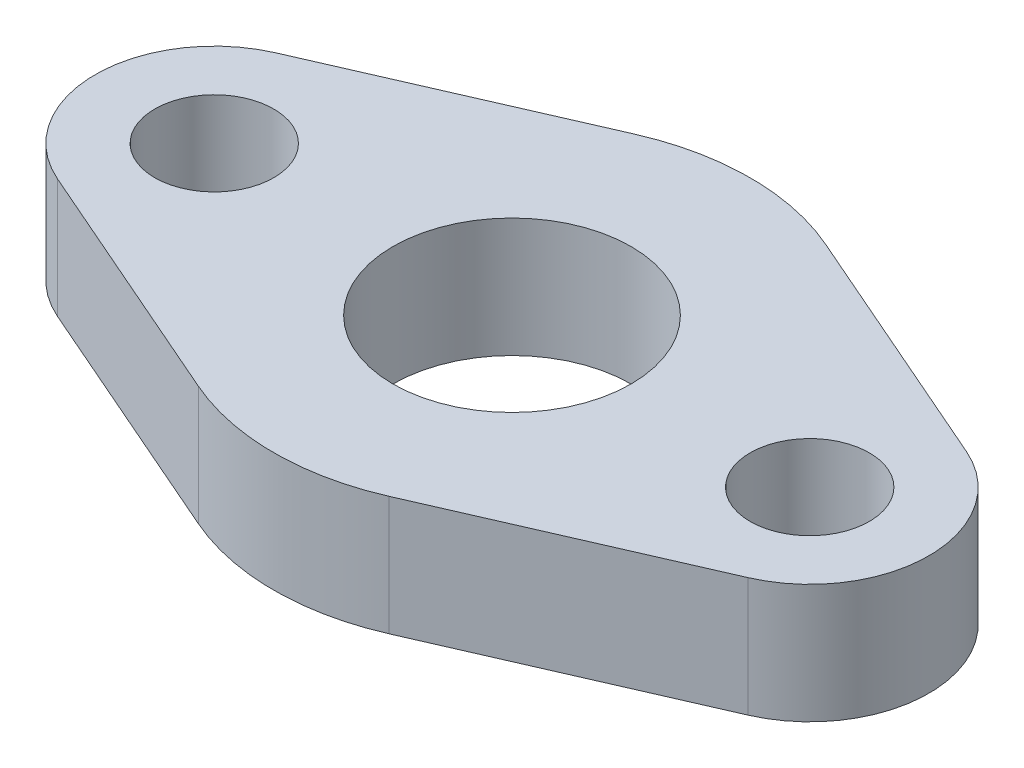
ISO-10303-21;
HEADER;
FILE_DESCRIPTION(('STEP AP214'),'2;1');
FILE_NAME('part.step','',(''),(''),'','','');
FILE_SCHEMA(('AUTOMOTIVE_DESIGN { 1 0 10303 214 1 1 1 1 }'));
ENDSEC;
DATA;
#1=APPLICATION_CONTEXT('core data for automotive mechanical design processes');
#2=APPLICATION_PROTOCOL_DEFINITION('international standard','automotive_design',2000,#1);
#3=PRODUCT_CONTEXT('',#1,'mechanical');
#4=PRODUCT('Part','Part','',(#3));
#5=PRODUCT_RELATED_PRODUCT_CATEGORY('part','',(#4));
#6=PRODUCT_DEFINITION_FORMATION('','',#4);
#7=PRODUCT_DEFINITION_CONTEXT('part definition',#1,'design');
#8=PRODUCT_DEFINITION('design','',#6,#7);
#9=PRODUCT_DEFINITION_SHAPE('','',#8);
#10=(LENGTH_UNIT() NAMED_UNIT(*) SI_UNIT(.MILLI.,.METRE.));
#11=(NAMED_UNIT(*) PLANE_ANGLE_UNIT() SI_UNIT($,.RADIAN.));
#12=(NAMED_UNIT(*) SI_UNIT($,.STERADIAN.) SOLID_ANGLE_UNIT());
#13=UNCERTAINTY_MEASURE_WITH_UNIT(LENGTH_MEASURE(1.E-05),#10,'distance_accuracy_value','');
#14=(GEOMETRIC_REPRESENTATION_CONTEXT(3) GLOBAL_UNCERTAINTY_ASSIGNED_CONTEXT((#13)) GLOBAL_UNIT_ASSIGNED_CONTEXT((#10,
#11,#12)) REPRESENTATION_CONTEXT('',''));
#15=CARTESIAN_POINT('',(0.,0.,0.));
#16=DIRECTION('',(0.,0.,1.));
#17=DIRECTION('',(1.,0.,0.));
#18=AXIS2_PLACEMENT_3D('',#15,#16,#17);
#19=CARTESIAN_POINT('',(0.,40.,0.));
#20=DIRECTION('',(0.,1.,0.));
#21=DIRECTION('',(0.,0.,1.));
#22=AXIS2_PLACEMENT_3D('',#19,#20,#21);
#23=PLANE('',#22);
#24=CARTESIAN_POINT('',(100.,40.,0.));
#25=DIRECTION('',(0.,1.,0.));
#26=DIRECTION('',(0.,0.,1.));
#27=AXIS2_PLACEMENT_3D('',#24,#25,#26);
#28=CIRCLE('',#27,20.);
#29=CARTESIAN_POINT('',(100.,40.,20.));
#30=VERTEX_POINT('',#29);
#31=EDGE_CURVE('E180',#30,#30,#28,.T.);
#32=ORIENTED_EDGE('',*,*,#31,.F.);
#33=EDGE_LOOP('',(#32));
#34=FACE_BOUND('',#33,.T.);
#35=CARTESIAN_POINT('',(0.,40.,0.));
#36=DIRECTION('',(0.,1.,0.));
#37=DIRECTION('',(0.,0.,1.));
#38=AXIS2_PLACEMENT_3D('',#35,#36,#37);
#39=CIRCLE('',#38,80.);
#40=CARTESIAN_POINT('',(32.,40.,-73.3212111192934));
#41=VERTEX_POINT('',#40);
#42=CARTESIAN_POINT('',(-32.,40.,-73.3212111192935));
#43=VERTEX_POINT('',#42);
#44=EDGE_CURVE('E143',#41,#43,#39,.T.);
#45=ORIENTED_EDGE('',*,*,#44,.T.);
#46=DIRECTION('',(-0.916515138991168,0.,0.4));
#47=VECTOR('',#46,1.);
#48=CARTESIAN_POINT('',(-32.,40.,-73.3212111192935));
#49=LINE('',#48,#47);
#50=CARTESIAN_POINT('',(-116.,40.,-36.6606055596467));
#51=VERTEX_POINT('',#50);
#52=EDGE_CURVE('E91',#43,#51,#49,.T.);
#53=ORIENTED_EDGE('',*,*,#52,.T.);
#54=CARTESIAN_POINT('',(-100.,40.,0.));
#55=DIRECTION('',(0.,1.,0.));
#56=DIRECTION('',(0.,0.,1.));
#57=AXIS2_PLACEMENT_3D('',#54,#55,#56);
#58=CIRCLE('',#57,40.);
#59=CARTESIAN_POINT('',(-116.,40.,36.6606055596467));
#60=VERTEX_POINT('',#59);
#61=EDGE_CURVE('E158',#51,#60,#58,.T.);
#62=ORIENTED_EDGE('',*,*,#61,.T.);
#63=DIRECTION('',(0.916515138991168,0.,0.4));
#64=VECTOR('',#63,1.);
#65=CARTESIAN_POINT('',(-32.,40.,73.3212111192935));
#66=LINE('',#65,#64);
#67=CARTESIAN_POINT('',(-32.,40.,73.3212111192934));
#68=VERTEX_POINT('',#67);
#69=EDGE_CURVE('E171',#60,#68,#66,.T.);
#70=ORIENTED_EDGE('',*,*,#69,.T.);
#71=CARTESIAN_POINT('',(0.,40.,0.));
#72=DIRECTION('',(0.,1.,0.));
#73=DIRECTION('',(0.,0.,1.));
#74=AXIS2_PLACEMENT_3D('',#71,#72,#73);
#75=CIRCLE('',#74,80.);
#76=CARTESIAN_POINT('',(32.,40.,73.3212111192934));
#77=VERTEX_POINT('',#76);
#78=EDGE_CURVE('E110',#68,#77,#75,.T.);
#79=ORIENTED_EDGE('',*,*,#78,.T.);
#80=DIRECTION('',(0.916515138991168,0.,-0.4));
#81=VECTOR('',#80,1.);
#82=CARTESIAN_POINT('',(116.,40.,36.6606055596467));
#83=LINE('',#82,#81);
#84=CARTESIAN_POINT('',(116.,40.,36.6606055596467));
#85=VERTEX_POINT('',#84);
#86=EDGE_CURVE('E104',#77,#85,#83,.T.);
#87=ORIENTED_EDGE('',*,*,#86,.T.);
#88=CARTESIAN_POINT('',(100.,40.,0.));
#89=DIRECTION('',(0.,1.,0.));
#90=DIRECTION('',(0.,0.,1.));
#91=AXIS2_PLACEMENT_3D('',#88,#89,#90);
#92=CIRCLE('',#91,40.);
#93=CARTESIAN_POINT('',(116.,40.,-36.6606055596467));
#94=VERTEX_POINT('',#93);
#95=EDGE_CURVE('E108',#85,#94,#92,.T.);
#96=ORIENTED_EDGE('',*,*,#95,.T.);
#97=DIRECTION('',(-0.916515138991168,0.,-0.4));
#98=VECTOR('',#97,1.);
#99=CARTESIAN_POINT('',(32.,40.,-73.3212111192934));
#100=LINE('',#99,#98);
#101=EDGE_CURVE('E48',#94,#41,#100,.T.);
#102=ORIENTED_EDGE('',*,*,#101,.T.);
#103=EDGE_LOOP('',(#45,#53,#62,#70,#79,#87,#96,#102));
#104=FACE_BOUND('',#103,.T.);
#105=CARTESIAN_POINT('',(0.,40.,0.));
#106=DIRECTION('',(0.,1.,0.));
#107=DIRECTION('',(0.,0.,1.));
#108=AXIS2_PLACEMENT_3D('',#105,#106,#107);
#109=CIRCLE('',#108,40.);
#110=CARTESIAN_POINT('',(0.,40.,40.));
#111=VERTEX_POINT('',#110);
#112=EDGE_CURVE('E132',#111,#111,#109,.T.);
#113=ORIENTED_EDGE('',*,*,#112,.F.);
#114=EDGE_LOOP('',(#113));
#115=FACE_BOUND('',#114,.T.);
#116=CARTESIAN_POINT('',(-100.,40.,0.));
#117=DIRECTION('',(0.,1.,0.));
#118=DIRECTION('',(0.,0.,1.));
#119=AXIS2_PLACEMENT_3D('',#116,#117,#118);
#120=CIRCLE('',#119,20.);
#121=CARTESIAN_POINT('',(-100.,40.,20.));
#122=VERTEX_POINT('',#121);
#123=EDGE_CURVE('E186',#122,#122,#120,.T.);
#124=ORIENTED_EDGE('',*,*,#123,.F.);
#125=EDGE_LOOP('',(#124));
#126=FACE_BOUND('',#125,.T.);
#127=ADVANCED_FACE('F31',(#34,#104,#115,#126),#23,.T.);
#128=CARTESIAN_POINT('',(0.,0.,0.));
#129=DIRECTION('',(0.,1.,0.));
#130=DIRECTION('',(0.,0.,1.));
#131=AXIS2_PLACEMENT_3D('',#128,#129,#130);
#132=PLANE('',#131);
#133=CARTESIAN_POINT('',(100.,0.,0.));
#134=DIRECTION('',(0.,1.,0.));
#135=DIRECTION('',(0.,0.,1.));
#136=AXIS2_PLACEMENT_3D('',#133,#134,#135);
#137=CIRCLE('',#136,20.);
#138=CARTESIAN_POINT('',(100.,0.,20.));
#139=VERTEX_POINT('',#138);
#140=EDGE_CURVE('E183',#139,#139,#137,.T.);
#141=ORIENTED_EDGE('',*,*,#140,.T.);
#142=EDGE_LOOP('',(#141));
#143=FACE_BOUND('',#142,.T.);
#144=CARTESIAN_POINT('',(0.,0.,0.));
#145=DIRECTION('',(0.,1.,0.));
#146=DIRECTION('',(0.,0.,1.));
#147=AXIS2_PLACEMENT_3D('',#144,#145,#146);
#148=CIRCLE('',#147,80.);
#149=CARTESIAN_POINT('',(32.,0.,-73.3212111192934));
#150=VERTEX_POINT('',#149);
#151=CARTESIAN_POINT('',(-32.,0.,-73.3212111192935));
#152=VERTEX_POINT('',#151);
#153=EDGE_CURVE('E128',#150,#152,#148,.T.);
#154=ORIENTED_EDGE('',*,*,#153,.F.);
#155=DIRECTION('',(-0.916515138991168,0.,-0.4));
#156=VECTOR('',#155,1.);
#157=CARTESIAN_POINT('',(32.,0.,-73.3212111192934));
#158=LINE('',#157,#156);
#159=CARTESIAN_POINT('',(116.,0.,-36.6606055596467));
#160=VERTEX_POINT('',#159);
#161=EDGE_CURVE('E83',#160,#150,#158,.T.);
#162=ORIENTED_EDGE('',*,*,#161,.F.);
#163=CARTESIAN_POINT('',(100.,0.,0.));
#164=DIRECTION('',(0.,1.,0.));
#165=DIRECTION('',(0.,0.,1.));
#166=AXIS2_PLACEMENT_3D('',#163,#164,#165);
#167=CIRCLE('',#166,40.);
#168=CARTESIAN_POINT('',(116.,0.,36.6606055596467));
#169=VERTEX_POINT('',#168);
#170=EDGE_CURVE('E77',#169,#160,#167,.T.);
#171=ORIENTED_EDGE('',*,*,#170,.F.);
#172=DIRECTION('',(0.916515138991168,0.,-0.4));
#173=VECTOR('',#172,1.);
#174=CARTESIAN_POINT('',(116.,0.,36.6606055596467));
#175=LINE('',#174,#173);
#176=CARTESIAN_POINT('',(32.,0.,73.3212111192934));
#177=VERTEX_POINT('',#176);
#178=EDGE_CURVE('E118',#177,#169,#175,.T.);
#179=ORIENTED_EDGE('',*,*,#178,.F.);
#180=CARTESIAN_POINT('',(0.,0.,0.));
#181=DIRECTION('',(0.,1.,0.));
#182=DIRECTION('',(0.,0.,1.));
#183=AXIS2_PLACEMENT_3D('',#180,#181,#182);
#184=CIRCLE('',#183,80.);
#185=CARTESIAN_POINT('',(-32.,0.,73.3212111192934));
#186=VERTEX_POINT('',#185);
#187=EDGE_CURVE('E138',#186,#177,#184,.T.);
#188=ORIENTED_EDGE('',*,*,#187,.F.);
#189=DIRECTION('',(0.916515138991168,0.,0.4));
#190=VECTOR('',#189,1.);
#191=CARTESIAN_POINT('',(-32.,0.,73.3212111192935));
#192=LINE('',#191,#190);
#193=CARTESIAN_POINT('',(-116.,0.,36.6606055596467));
#194=VERTEX_POINT('',#193);
#195=EDGE_CURVE('E136',#194,#186,#192,.T.);
#196=ORIENTED_EDGE('',*,*,#195,.F.);
#197=CARTESIAN_POINT('',(-100.,0.,0.));
#198=DIRECTION('',(0.,1.,0.));
#199=DIRECTION('',(0.,0.,1.));
#200=AXIS2_PLACEMENT_3D('',#197,#198,#199);
#201=CIRCLE('',#200,40.);
#202=CARTESIAN_POINT('',(-116.,0.,-36.6606055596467));
#203=VERTEX_POINT('',#202);
#204=EDGE_CURVE('E134',#203,#194,#201,.T.);
#205=ORIENTED_EDGE('',*,*,#204,.F.);
#206=DIRECTION('',(-0.916515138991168,0.,0.4));
#207=VECTOR('',#206,1.);
#208=CARTESIAN_POINT('',(-32.,0.,-73.3212111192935));
#209=LINE('',#208,#207);
#210=EDGE_CURVE('E131',#152,#203,#209,.T.);
#211=ORIENTED_EDGE('',*,*,#210,.F.);
#212=EDGE_LOOP('',(#154,#162,#171,#179,#188,#196,#205,#211));
#213=FACE_BOUND('',#212,.T.);
#214=CARTESIAN_POINT('',(0.,0.,0.));
#215=DIRECTION('',(0.,1.,0.));
#216=DIRECTION('',(0.,0.,1.));
#217=AXIS2_PLACEMENT_3D('',#214,#215,#216);
#218=CIRCLE('',#217,40.);
#219=CARTESIAN_POINT('',(0.,0.,40.));
#220=VERTEX_POINT('',#219);
#221=EDGE_CURVE('E177',#220,#220,#218,.T.);
#222=ORIENTED_EDGE('',*,*,#221,.T.);
#223=EDGE_LOOP('',(#222));
#224=FACE_BOUND('',#223,.T.);
#225=CARTESIAN_POINT('',(-100.,0.,0.));
#226=DIRECTION('',(0.,1.,0.));
#227=DIRECTION('',(0.,0.,1.));
#228=AXIS2_PLACEMENT_3D('',#225,#226,#227);
#229=CIRCLE('',#228,20.);
#230=CARTESIAN_POINT('',(-100.,0.,20.));
#231=VERTEX_POINT('',#230);
#232=EDGE_CURVE('E189',#231,#231,#229,.T.);
#233=ORIENTED_EDGE('',*,*,#232,.T.);
#234=EDGE_LOOP('',(#233));
#235=FACE_BOUND('',#234,.T.);
#236=ADVANCED_FACE('F162',(#143,#213,#224,#235),#132,.F.);
#237=CARTESIAN_POINT('',(0.,40.,0.));
#238=DIRECTION('',(0.,-1.,0.));
#239=DIRECTION('',(0.,0.,-1.));
#240=AXIS2_PLACEMENT_3D('',#237,#238,#239);
#241=CYLINDRICAL_SURFACE('',#240,80.);
#242=ORIENTED_EDGE('',*,*,#153,.T.);
#243=DIRECTION('',(0.,-1.,0.));
#244=VECTOR('',#243,1.);
#245=CARTESIAN_POINT('',(-32.,40.,-73.3212111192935));
#246=LINE('',#245,#244);
#247=EDGE_CURVE('E11',#43,#152,#246,.T.);
#248=ORIENTED_EDGE('',*,*,#247,.F.);
#249=ORIENTED_EDGE('',*,*,#44,.F.);
#250=DIRECTION('',(0.,-1.,0.));
#251=VECTOR('',#250,1.);
#252=CARTESIAN_POINT('',(32.,40.,-73.3212111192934));
#253=LINE('',#252,#251);
#254=EDGE_CURVE('E124',#41,#150,#253,.T.);
#255=ORIENTED_EDGE('',*,*,#254,.T.);
#256=EDGE_LOOP('',(#242,#248,#249,#255));
#257=FACE_BOUND('',#256,.T.);
#258=ADVANCED_FACE('F33',(#257),#241,.T.);
#259=CARTESIAN_POINT('',(-32.,40.,-73.3212111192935));
#260=DIRECTION('',(0.4,0.,0.916515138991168));
#261=DIRECTION('',(0.916515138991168,0.,-0.4));
#262=AXIS2_PLACEMENT_3D('',#259,#260,#261);
#263=PLANE('',#262);
#264=ORIENTED_EDGE('',*,*,#210,.T.);
#265=DIRECTION('',(0.,-1.,0.));
#266=VECTOR('',#265,1.);
#267=CARTESIAN_POINT('',(-116.,40.,-36.6606055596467));
#268=LINE('',#267,#266);
#269=EDGE_CURVE('E40',#51,#203,#268,.T.);
#270=ORIENTED_EDGE('',*,*,#269,.F.);
#271=ORIENTED_EDGE('',*,*,#52,.F.);
#272=ORIENTED_EDGE('',*,*,#247,.T.);
#273=EDGE_LOOP('',(#264,#270,#271,#272));
#274=FACE_BOUND('',#273,.T.);
#275=ADVANCED_FACE('F223',(#274),#263,.F.);
#276=CARTESIAN_POINT('',(-100.,40.,0.));
#277=DIRECTION('',(0.,-1.,0.));
#278=DIRECTION('',(0.,0.,-1.));
#279=AXIS2_PLACEMENT_3D('',#276,#277,#278);
#280=CYLINDRICAL_SURFACE('',#279,40.);
#281=ORIENTED_EDGE('',*,*,#204,.T.);
#282=DIRECTION('',(0.,-1.,0.));
#283=VECTOR('',#282,1.);
#284=CARTESIAN_POINT('',(-116.,40.,36.6606055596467));
#285=LINE('',#284,#283);
#286=EDGE_CURVE('E150',#60,#194,#285,.T.);
#287=ORIENTED_EDGE('',*,*,#286,.F.);
#288=ORIENTED_EDGE('',*,*,#61,.F.);
#289=ORIENTED_EDGE('',*,*,#269,.T.);
#290=EDGE_LOOP('',(#281,#287,#288,#289));
#291=FACE_BOUND('',#290,.T.);
#292=ADVANCED_FACE('F156',(#291),#280,.T.);
#293=CARTESIAN_POINT('',(-32.,40.,73.3212111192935));
#294=DIRECTION('',(0.4,0.,-0.916515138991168));
#295=DIRECTION('',(-0.916515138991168,0.,-0.4));
#296=AXIS2_PLACEMENT_3D('',#293,#294,#295);
#297=PLANE('',#296);
#298=ORIENTED_EDGE('',*,*,#195,.T.);
#299=DIRECTION('',(0.,-1.,0.));
#300=VECTOR('',#299,1.);
#301=CARTESIAN_POINT('',(-32.,40.,73.3212111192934));
#302=LINE('',#301,#300);
#303=EDGE_CURVE('E147',#68,#186,#302,.T.);
#304=ORIENTED_EDGE('',*,*,#303,.F.);
#305=ORIENTED_EDGE('',*,*,#69,.F.);
#306=ORIENTED_EDGE('',*,*,#286,.T.);
#307=EDGE_LOOP('',(#298,#304,#305,#306));
#308=FACE_BOUND('',#307,.T.);
#309=ADVANCED_FACE('F167',(#308),#297,.F.);
#310=CARTESIAN_POINT('',(0.,40.,0.));
#311=DIRECTION('',(0.,-1.,0.));
#312=DIRECTION('',(0.,0.,-1.));
#313=AXIS2_PLACEMENT_3D('',#310,#311,#312);
#314=CYLINDRICAL_SURFACE('',#313,80.);
#315=ORIENTED_EDGE('',*,*,#187,.T.);
#316=DIRECTION('',(0.,-1.,0.));
#317=VECTOR('',#316,1.);
#318=CARTESIAN_POINT('',(32.,40.,73.3212111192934));
#319=LINE('',#318,#317);
#320=EDGE_CURVE('E119',#77,#177,#319,.T.);
#321=ORIENTED_EDGE('',*,*,#320,.F.);
#322=ORIENTED_EDGE('',*,*,#78,.F.);
#323=ORIENTED_EDGE('',*,*,#303,.T.);
#324=EDGE_LOOP('',(#315,#321,#322,#323));
#325=FACE_BOUND('',#324,.T.);
#326=ADVANCED_FACE('F170',(#325),#314,.T.);
#327=CARTESIAN_POINT('',(116.,40.,36.6606055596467));
#328=DIRECTION('',(-0.4,0.,-0.916515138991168));
#329=DIRECTION('',(-0.916515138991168,0.,0.4));
#330=AXIS2_PLACEMENT_3D('',#327,#328,#329);
#331=PLANE('',#330);
#332=ORIENTED_EDGE('',*,*,#178,.T.);
#333=DIRECTION('',(0.,-1.,0.));
#334=VECTOR('',#333,1.);
#335=CARTESIAN_POINT('',(116.,40.,36.6606055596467));
#336=LINE('',#335,#334);
#337=EDGE_CURVE('E115',#85,#169,#336,.T.);
#338=ORIENTED_EDGE('',*,*,#337,.F.);
#339=ORIENTED_EDGE('',*,*,#86,.F.);
#340=ORIENTED_EDGE('',*,*,#320,.T.);
#341=EDGE_LOOP('',(#332,#338,#339,#340));
#342=FACE_BOUND('',#341,.T.);
#343=ADVANCED_FACE('F116',(#342),#331,.F.);
#344=CARTESIAN_POINT('',(100.,40.,0.));
#345=DIRECTION('',(0.,-1.,0.));
#346=DIRECTION('',(0.,0.,-1.));
#347=AXIS2_PLACEMENT_3D('',#344,#345,#346);
#348=CYLINDRICAL_SURFACE('',#347,40.);
#349=ORIENTED_EDGE('',*,*,#170,.T.);
#350=DIRECTION('',(0.,-1.,0.));
#351=VECTOR('',#350,1.);
#352=CARTESIAN_POINT('',(116.,40.,-36.6606055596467));
#353=LINE('',#352,#351);
#354=EDGE_CURVE('E120',#94,#160,#353,.T.);
#355=ORIENTED_EDGE('',*,*,#354,.F.);
#356=ORIENTED_EDGE('',*,*,#95,.F.);
#357=ORIENTED_EDGE('',*,*,#337,.T.);
#358=EDGE_LOOP('',(#349,#355,#356,#357));
#359=FACE_BOUND('',#358,.T.);
#360=ADVANCED_FACE('F122',(#359),#348,.T.);
#361=CARTESIAN_POINT('',(32.,40.,-73.3212111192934));
#362=DIRECTION('',(-0.4,0.,0.916515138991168));
#363=DIRECTION('',(0.916515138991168,0.,0.4));
#364=AXIS2_PLACEMENT_3D('',#361,#362,#363);
#365=PLANE('',#364);
#366=ORIENTED_EDGE('',*,*,#161,.T.);
#367=ORIENTED_EDGE('',*,*,#254,.F.);
#368=ORIENTED_EDGE('',*,*,#101,.F.);
#369=ORIENTED_EDGE('',*,*,#354,.T.);
#370=EDGE_LOOP('',(#366,#367,#368,#369));
#371=FACE_BOUND('',#370,.T.);
#372=ADVANCED_FACE('F211',(#371),#365,.F.);
#373=CARTESIAN_POINT('',(0.,40.,0.));
#374=DIRECTION('',(0.,-1.,0.));
#375=DIRECTION('',(0.,0.,-1.));
#376=AXIS2_PLACEMENT_3D('',#373,#374,#375);
#377=CYLINDRICAL_SURFACE('',#376,40.);
#378=ORIENTED_EDGE('',*,*,#112,.T.);
#379=EDGE_LOOP('',(#378));
#380=FACE_BOUND('',#379,.T.);
#381=ORIENTED_EDGE('',*,*,#221,.F.);
#382=EDGE_LOOP('',(#381));
#383=FACE_BOUND('',#382,.T.);
#384=ADVANCED_FACE('F208',(#380,#383),#377,.F.);
#385=CARTESIAN_POINT('',(100.,40.,0.));
#386=DIRECTION('',(0.,-1.,0.));
#387=DIRECTION('',(0.,0.,-1.));
#388=AXIS2_PLACEMENT_3D('',#385,#386,#387);
#389=CYLINDRICAL_SURFACE('',#388,20.);
#390=ORIENTED_EDGE('',*,*,#31,.T.);
#391=EDGE_LOOP('',(#390));
#392=FACE_BOUND('',#391,.T.);
#393=ORIENTED_EDGE('',*,*,#140,.F.);
#394=EDGE_LOOP('',(#393));
#395=FACE_BOUND('',#394,.T.);
#396=ADVANCED_FACE('F287',(#392,#395),#389,.F.);
#397=CARTESIAN_POINT('',(-100.,40.,0.));
#398=DIRECTION('',(0.,-1.,0.));
#399=DIRECTION('',(0.,0.,-1.));
#400=AXIS2_PLACEMENT_3D('',#397,#398,#399);
#401=CYLINDRICAL_SURFACE('',#400,20.);
#402=ORIENTED_EDGE('',*,*,#123,.T.);
#403=EDGE_LOOP('',(#402));
#404=FACE_BOUND('',#403,.T.);
#405=ORIENTED_EDGE('',*,*,#232,.F.);
#406=EDGE_LOOP('',(#405));
#407=FACE_BOUND('',#406,.T.);
#408=ADVANCED_FACE('F195',(#404,#407),#401,.F.);
#409=CLOSED_SHELL('',(#127,#236,#258,#275,#292,#309,#326,#343,#360,#372,#384,#396,#408));
#410=MANIFOLD_SOLID_BREP('B2',#409);
#411=ADVANCED_BREP_SHAPE_REPRESENTATION('',(#18,#410),#14);
#412=SHAPE_DEFINITION_REPRESENTATION(#9,#411);
ENDSEC;
END-ISO-10303-21;
